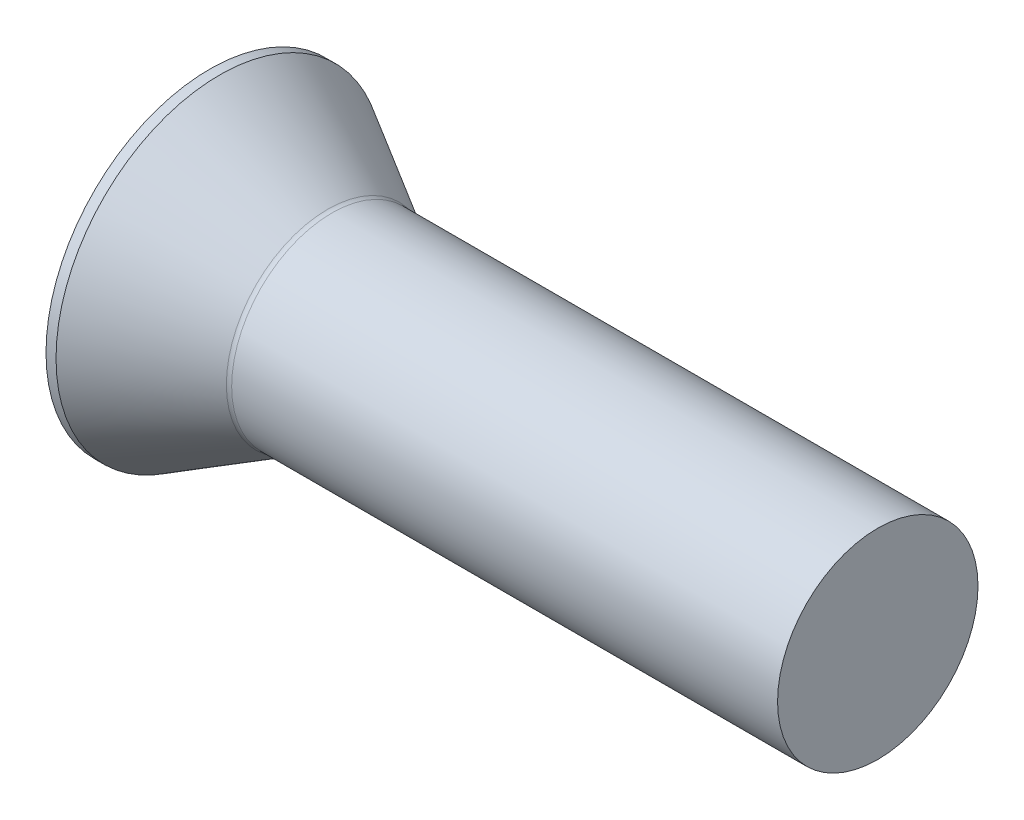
ISO-10303-21;
HEADER;
FILE_DESCRIPTION(('STEP AP214'),'2;1');
FILE_NAME('part.step','',(''),(''),'','','');
FILE_SCHEMA(('AUTOMOTIVE_DESIGN { 1 0 10303 214 1 1 1 1 }'));
ENDSEC;
DATA;
#1=APPLICATION_CONTEXT('core data for automotive mechanical design processes');
#2=APPLICATION_PROTOCOL_DEFINITION('international standard','automotive_design',2000,#1);
#3=PRODUCT_CONTEXT('',#1,'mechanical');
#4=PRODUCT('Part','Part','',(#3));
#5=PRODUCT_RELATED_PRODUCT_CATEGORY('part','',(#4));
#6=PRODUCT_DEFINITION_FORMATION('','',#4);
#7=PRODUCT_DEFINITION_CONTEXT('part definition',#1,'design');
#8=PRODUCT_DEFINITION('design','',#6,#7);
#9=PRODUCT_DEFINITION_SHAPE('','',#8);
#10=(LENGTH_UNIT() NAMED_UNIT(*) SI_UNIT(.MILLI.,.METRE.));
#11=(NAMED_UNIT(*) PLANE_ANGLE_UNIT() SI_UNIT($,.RADIAN.));
#12=(NAMED_UNIT(*) SI_UNIT($,.STERADIAN.) SOLID_ANGLE_UNIT());
#13=UNCERTAINTY_MEASURE_WITH_UNIT(LENGTH_MEASURE(1.E-05),#10,'distance_accuracy_value','');
#14=(GEOMETRIC_REPRESENTATION_CONTEXT(3) GLOBAL_UNCERTAINTY_ASSIGNED_CONTEXT((#13)) GLOBAL_UNIT_ASSIGNED_CONTEXT((#10,
#11,#12)) REPRESENTATION_CONTEXT('',''));
#15=CARTESIAN_POINT('',(0.,0.,0.));
#16=DIRECTION('',(0.,0.,1.));
#17=DIRECTION('',(1.,0.,0.));
#18=AXIS2_PLACEMENT_3D('',#15,#16,#17);
#19=CARTESIAN_POINT('',(40.,6.00000000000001,0.));
#20=DIRECTION('',(-1.,0.,0.));
#21=DIRECTION('',(0.,0.,1.));
#22=AXIS2_PLACEMENT_3D('',#19,#20,#21);
#23=PLANE('',#22);
#24=CARTESIAN_POINT('',(40.,0.,0.));
#25=DIRECTION('',(-1.,0.,0.));
#26=DIRECTION('',(0.,0.,1.));
#27=AXIS2_PLACEMENT_3D('',#24,#25,#26);
#28=CIRCLE('',#27,6.00000000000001);
#29=CARTESIAN_POINT('',(40.,0.,6.00000000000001));
#30=VERTEX_POINT('',#29);
#31=EDGE_CURVE('E41',#30,#30,#28,.T.);
#32=ORIENTED_EDGE('',*,*,#31,.F.);
#33=EDGE_LOOP('',(#32));
#34=FACE_BOUND('',#33,.T.);
#35=ADVANCED_FACE('F30',(#34),#23,.F.);
#36=CARTESIAN_POINT('',(-2.03,0.,0.));
#37=DIRECTION('',(-1.,0.,0.));
#38=DIRECTION('',(0.,0.,1.));
#39=AXIS2_PLACEMENT_3D('',#36,#37,#38);
#40=CYLINDRICAL_SURFACE('',#39,6.);
#41=CARTESIAN_POINT('',(7.31576766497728,0.,0.));
#42=DIRECTION('',(-1.,0.,0.));
#43=DIRECTION('',(0.,0.,1.));
#44=AXIS2_PLACEMENT_3D('',#41,#42,#43);
#45=CIRCLE('',#44,6.);
#46=CARTESIAN_POINT('',(7.31576766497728,0.,6.));
#47=VERTEX_POINT('',#46);
#48=EDGE_CURVE('E10',#47,#47,#45,.F.);
#49=ORIENTED_EDGE('',*,*,#48,.T.);
#50=EDGE_LOOP('',(#49));
#51=FACE_BOUND('',#50,.T.);
#52=ORIENTED_EDGE('',*,*,#31,.T.);
#53=EDGE_LOOP('',(#52));
#54=FACE_BOUND('',#53,.T.);
#55=ADVANCED_FACE('F64',(#51,#54),#40,.T.);
#56=CARTESIAN_POINT('',(7.18179306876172,0.,0.));
#57=DIRECTION('',(-1.,0.,0.));
#58=DIRECTION('',(0.,0.,1.));
#59=AXIS2_PLACEMENT_3D('',#56,#57,#58);
#60=CONICAL_SURFACE('',#59,6.,0.523598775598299);
#61=CARTESIAN_POINT('',(7.06576766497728,0.,0.));
#62=DIRECTION('',(-1.,0.,0.));
#63=DIRECTION('',(0.,0.,1.));
#64=AXIS2_PLACEMENT_3D('',#61,#62,#63);
#65=CIRCLE('',#64,6.06698729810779);
#66=CARTESIAN_POINT('',(7.06576766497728,0.,6.06698729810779));
#67=VERTEX_POINT('',#66);
#68=EDGE_CURVE('E37',#67,#67,#65,.T.);
#69=ORIENTED_EDGE('',*,*,#68,.T.);
#70=EDGE_LOOP('',(#69));
#71=FACE_BOUND('',#70,.T.);
#72=CARTESIAN_POINT('',(0.6,0.,0.));
#73=DIRECTION('',(-1.,0.,0.));
#74=DIRECTION('',(0.,0.,1.));
#75=AXIS2_PLACEMENT_3D('',#72,#73,#74);
#76=CIRCLE('',#75,9.8);
#77=CARTESIAN_POINT('',(0.6,0.,9.8));
#78=VERTEX_POINT('',#77);
#79=EDGE_CURVE('E45',#78,#78,#76,.T.);
#80=ORIENTED_EDGE('',*,*,#79,.F.);
#81=EDGE_LOOP('',(#80));
#82=FACE_BOUND('',#81,.T.);
#83=ADVANCED_FACE('F59',(#71,#82),#60,.T.);
#84=CARTESIAN_POINT('',(-2.03,0.,0.));
#85=DIRECTION('',(-1.,0.,0.));
#86=DIRECTION('',(0.,0.,1.));
#87=AXIS2_PLACEMENT_3D('',#84,#85,#86);
#88=CYLINDRICAL_SURFACE('',#87,9.8);
#89=CARTESIAN_POINT('',(0.,0.,0.));
#90=DIRECTION('',(-1.,0.,0.));
#91=DIRECTION('',(0.,0.,1.));
#92=AXIS2_PLACEMENT_3D('',#89,#90,#91);
#93=CIRCLE('',#92,9.8);
#94=CARTESIAN_POINT('',(0.,0.,9.8));
#95=VERTEX_POINT('',#94);
#96=EDGE_CURVE('E50',#95,#95,#93,.T.);
#97=ORIENTED_EDGE('',*,*,#96,.F.);
#98=EDGE_LOOP('',(#97));
#99=FACE_BOUND('',#98,.T.);
#100=ORIENTED_EDGE('',*,*,#79,.T.);
#101=EDGE_LOOP('',(#100));
#102=FACE_BOUND('',#101,.T.);
#103=ADVANCED_FACE('F56',(#99,#102),#88,.T.);
#104=CARTESIAN_POINT('',(0.,0.,0.));
#105=DIRECTION('',(1.,0.,0.));
#106=DIRECTION('',(0.,0.,-1.));
#107=AXIS2_PLACEMENT_3D('',#104,#105,#106);
#108=PLANE('',#107);
#109=ORIENTED_EDGE('',*,*,#96,.T.);
#110=EDGE_LOOP('',(#109));
#111=FACE_BOUND('',#110,.T.);
#112=ADVANCED_FACE('F54',(#111),#108,.F.);
#113=CARTESIAN_POINT('',(7.31576766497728,0.,0.));
#114=DIRECTION('',(-1.,0.,0.));
#115=DIRECTION('',(0.,0.,1.));
#116=AXIS2_PLACEMENT_3D('',#113,#114,#115);
#117=TOROIDAL_SURFACE('',#116,6.5,0.5);
#118=ORIENTED_EDGE('',*,*,#48,.F.);
#119=EDGE_LOOP('',(#118));
#120=FACE_BOUND('',#119,.T.);
#121=ORIENTED_EDGE('',*,*,#68,.F.);
#122=EDGE_LOOP('',(#121));
#123=FACE_BOUND('',#122,.T.);
#124=ADVANCED_FACE('F32',(#120,#123),#117,.F.);
#125=CLOSED_SHELL('',(#35,#55,#83,#103,#112,#124));
#126=MANIFOLD_SOLID_BREP('B2',#125);
#127=ADVANCED_BREP_SHAPE_REPRESENTATION('',(#18,#126),#14);
#128=SHAPE_DEFINITION_REPRESENTATION(#9,#127);
ENDSEC;
END-ISO-10303-21;
